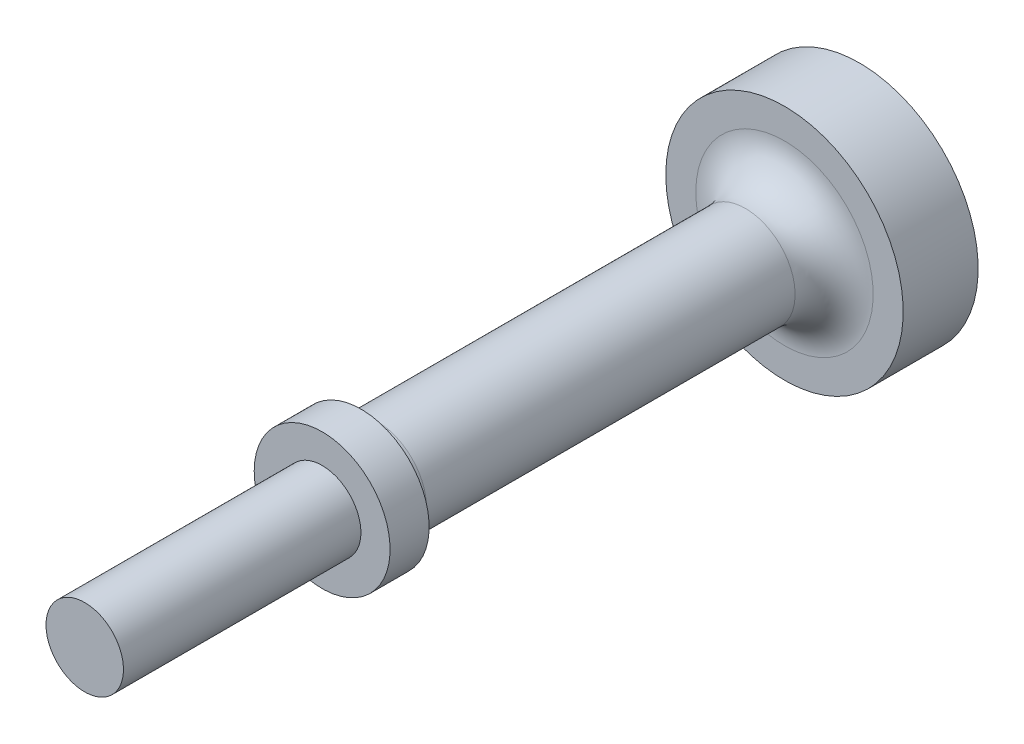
ISO-10303-21;
HEADER;
FILE_DESCRIPTION(('STEP AP214'),'2;1');
FILE_NAME('part.step','',(''),(''),'','','');
FILE_SCHEMA(('AUTOMOTIVE_DESIGN { 1 0 10303 214 1 1 1 1 }'));
ENDSEC;
DATA;
#1=APPLICATION_CONTEXT('core data for automotive mechanical design processes');
#2=APPLICATION_PROTOCOL_DEFINITION('international standard','automotive_design',2000,#1);
#3=PRODUCT_CONTEXT('',#1,'mechanical');
#4=PRODUCT('Part','Part','',(#3));
#5=PRODUCT_RELATED_PRODUCT_CATEGORY('part','',(#4));
#6=PRODUCT_DEFINITION_FORMATION('','',#4);
#7=PRODUCT_DEFINITION_CONTEXT('part definition',#1,'design');
#8=PRODUCT_DEFINITION('design','',#6,#7);
#9=PRODUCT_DEFINITION_SHAPE('','',#8);
#10=(LENGTH_UNIT() NAMED_UNIT(*) SI_UNIT(.MILLI.,.METRE.));
#11=(NAMED_UNIT(*) PLANE_ANGLE_UNIT() SI_UNIT($,.RADIAN.));
#12=(NAMED_UNIT(*) SI_UNIT($,.STERADIAN.) SOLID_ANGLE_UNIT());
#13=UNCERTAINTY_MEASURE_WITH_UNIT(LENGTH_MEASURE(1.E-05),#10,'distance_accuracy_value','');
#14=(GEOMETRIC_REPRESENTATION_CONTEXT(3) GLOBAL_UNCERTAINTY_ASSIGNED_CONTEXT((#13)) GLOBAL_UNIT_ASSIGNED_CONTEXT((#10,
#11,#12)) REPRESENTATION_CONTEXT('',''));
#15=CARTESIAN_POINT('',(0.,0.,0.));
#16=DIRECTION('',(0.,0.,1.));
#17=DIRECTION('',(1.,0.,0.));
#18=AXIS2_PLACEMENT_3D('',#15,#16,#17);
#19=CARTESIAN_POINT('',(3.14960000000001,0.,0.));
#20=DIRECTION('',(0.,0.,-1.));
#21=DIRECTION('',(-1.,0.,0.));
#22=AXIS2_PLACEMENT_3D('',#19,#20,#21);
#23=PLANE('',#22);
#24=CARTESIAN_POINT('',(0.,0.,0.));
#25=DIRECTION('',(0.,0.,-1.));
#26=DIRECTION('',(-1.,0.,0.));
#27=AXIS2_PLACEMENT_3D('',#24,#25,#26);
#28=CIRCLE('',#27,3.14960000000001);
#29=CARTESIAN_POINT('',(-3.14960000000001,0.,0.));
#30=VERTEX_POINT('',#29);
#31=EDGE_CURVE('E10',#30,#30,#28,.T.);
#32=ORIENTED_EDGE('',*,*,#31,.F.);
#33=EDGE_LOOP('',(#32));
#34=FACE_BOUND('',#33,.T.);
#35=ADVANCED_FACE('F32',(#34),#23,.F.);
#36=CARTESIAN_POINT('',(0.,0.,-62.992));
#37=DIRECTION('',(0.,0.,-1.));
#38=DIRECTION('',(-1.,0.,0.));
#39=AXIS2_PLACEMENT_3D('',#36,#37,#38);
#40=CYLINDRICAL_SURFACE('',#39,3.14960000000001);
#41=CARTESIAN_POINT('',(0.,0.,-19.304));
#42=DIRECTION('',(0.,0.,-1.));
#43=DIRECTION('',(-1.,0.,0.));
#44=AXIS2_PLACEMENT_3D('',#41,#42,#43);
#45=CIRCLE('',#44,3.14960000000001);
#46=CARTESIAN_POINT('',(-3.14960000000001,0.,-19.304));
#47=VERTEX_POINT('',#46);
#48=EDGE_CURVE('E38',#47,#47,#45,.T.);
#49=ORIENTED_EDGE('',*,*,#48,.F.);
#50=EDGE_LOOP('',(#49));
#51=FACE_BOUND('',#50,.T.);
#52=ORIENTED_EDGE('',*,*,#31,.T.);
#53=EDGE_LOOP('',(#52));
#54=FACE_BOUND('',#53,.T.);
#55=ADVANCED_FACE('F116',(#51,#54),#40,.T.);
#56=CARTESIAN_POINT('',(5.52450000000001,0.,-19.304));
#57=DIRECTION('',(0.,0.,-1.));
#58=DIRECTION('',(-1.,0.,0.));
#59=AXIS2_PLACEMENT_3D('',#56,#57,#58);
#60=PLANE('',#59);
#61=CARTESIAN_POINT('',(0.,0.,-19.304));
#62=DIRECTION('',(0.,0.,-1.));
#63=DIRECTION('',(-1.,0.,0.));
#64=AXIS2_PLACEMENT_3D('',#61,#62,#63);
#65=CIRCLE('',#64,5.52450000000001);
#66=CARTESIAN_POINT('',(-5.52450000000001,0.,-19.304));
#67=VERTEX_POINT('',#66);
#68=EDGE_CURVE('E42',#67,#67,#65,.T.);
#69=ORIENTED_EDGE('',*,*,#68,.F.);
#70=EDGE_LOOP('',(#69));
#71=FACE_BOUND('',#70,.T.);
#72=ORIENTED_EDGE('',*,*,#48,.T.);
#73=EDGE_LOOP('',(#72));
#74=FACE_BOUND('',#73,.T.);
#75=ADVANCED_FACE('F111',(#71,#74),#60,.F.);
#76=CARTESIAN_POINT('',(0.,0.,-62.992));
#77=DIRECTION('',(0.,0.,-1.));
#78=DIRECTION('',(-1.,0.,0.));
#79=AXIS2_PLACEMENT_3D('',#76,#77,#78);
#80=CYLINDRICAL_SURFACE('',#79,5.52450000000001);
#81=CARTESIAN_POINT('',(0.,0.,-22.479));
#82=DIRECTION('',(0.,0.,-1.));
#83=DIRECTION('',(-1.,0.,0.));
#84=AXIS2_PLACEMENT_3D('',#81,#82,#83);
#85=CIRCLE('',#84,5.52450000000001);
#86=CARTESIAN_POINT('',(-5.52450000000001,0.,-22.479));
#87=VERTEX_POINT('',#86);
#88=EDGE_CURVE('E46',#87,#87,#85,.T.);
#89=ORIENTED_EDGE('',*,*,#88,.F.);
#90=EDGE_LOOP('',(#89));
#91=FACE_BOUND('',#90,.T.);
#92=ORIENTED_EDGE('',*,*,#68,.T.);
#93=EDGE_LOOP('',(#92));
#94=FACE_BOUND('',#93,.T.);
#95=ADVANCED_FACE('F105',(#91,#94),#80,.T.);
#96=CARTESIAN_POINT('',(5.30860000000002,0.,-22.479));
#97=DIRECTION('',(0.,0.,1.));
#98=DIRECTION('',(1.,0.,0.));
#99=AXIS2_PLACEMENT_3D('',#96,#97,#98);
#100=PLANE('',#99);
#101=CARTESIAN_POINT('',(0.,0.,-22.479));
#102=DIRECTION('',(0.,0.,-1.));
#103=DIRECTION('',(-1.,0.,0.));
#104=AXIS2_PLACEMENT_3D('',#101,#102,#103);
#105=CIRCLE('',#104,5.30860000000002);
#106=CARTESIAN_POINT('',(-5.30860000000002,0.,-22.479));
#107=VERTEX_POINT('',#106);
#108=EDGE_CURVE('E51',#107,#107,#105,.T.);
#109=ORIENTED_EDGE('',*,*,#108,.F.);
#110=EDGE_LOOP('',(#109));
#111=FACE_BOUND('',#110,.T.);
#112=ORIENTED_EDGE('',*,*,#88,.T.);
#113=EDGE_LOOP('',(#112));
#114=FACE_BOUND('',#113,.T.);
#115=ADVANCED_FACE('F99',(#111,#114),#100,.F.);
#116=CARTESIAN_POINT('',(0.,0.,-23.749));
#117=DIRECTION('',(0.,0.,-1.));
#118=DIRECTION('',(-1.,0.,0.));
#119=AXIS2_PLACEMENT_3D('',#116,#117,#118);
#120=TOROIDAL_SURFACE('',#119,5.3086,1.27);
#121=CARTESIAN_POINT('',(0.,0.,-23.749));
#122=DIRECTION('',(0.,0.,-1.));
#123=DIRECTION('',(-1.,0.,0.));
#124=AXIS2_PLACEMENT_3D('',#121,#122,#123);
#125=CIRCLE('',#124,4.0386);
#126=CARTESIAN_POINT('',(-4.03860000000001,0.,-23.749));
#127=VERTEX_POINT('',#126);
#128=EDGE_CURVE('E54',#127,#127,#125,.T.);
#129=ORIENTED_EDGE('',*,*,#128,.F.);
#130=EDGE_LOOP('',(#129));
#131=FACE_BOUND('',#130,.T.);
#132=ORIENTED_EDGE('',*,*,#108,.T.);
#133=EDGE_LOOP('',(#132));
#134=FACE_BOUND('',#133,.T.);
#135=ADVANCED_FACE('F93',(#131,#134),#120,.F.);
#136=CARTESIAN_POINT('',(0.,0.,-62.992));
#137=DIRECTION('',(0.,0.,-1.));
#138=DIRECTION('',(-1.,0.,0.));
#139=AXIS2_PLACEMENT_3D('',#136,#137,#138);
#140=CYLINDRICAL_SURFACE('',#139,4.03860000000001);
#141=CARTESIAN_POINT('',(0.,0.,-53.721));
#142=DIRECTION('',(0.,0.,-1.));
#143=DIRECTION('',(-1.,0.,0.));
#144=AXIS2_PLACEMENT_3D('',#141,#142,#143);
#145=CIRCLE('',#144,4.03860000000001);
#146=CARTESIAN_POINT('',(-4.03860000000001,0.,-53.721));
#147=VERTEX_POINT('',#146);
#148=EDGE_CURVE('E57',#147,#147,#145,.T.);
#149=ORIENTED_EDGE('',*,*,#148,.F.);
#150=EDGE_LOOP('',(#149));
#151=FACE_BOUND('',#150,.T.);
#152=ORIENTED_EDGE('',*,*,#128,.T.);
#153=EDGE_LOOP('',(#152));
#154=FACE_BOUND('',#153,.T.);
#155=ADVANCED_FACE('F87',(#151,#154),#140,.T.);
#156=CARTESIAN_POINT('',(0.,0.,-53.721));
#157=DIRECTION('',(0.,0.,-1.));
#158=DIRECTION('',(-1.,0.,0.));
#159=AXIS2_PLACEMENT_3D('',#156,#157,#158);
#160=TOROIDAL_SURFACE('',#159,7.2136,3.175);
#161=CARTESIAN_POINT('',(0.,0.,-56.896));
#162=DIRECTION('',(0.,0.,-1.));
#163=DIRECTION('',(-1.,0.,0.));
#164=AXIS2_PLACEMENT_3D('',#161,#162,#163);
#165=CIRCLE('',#164,7.2136);
#166=CARTESIAN_POINT('',(-7.2136,0.,-56.896));
#167=VERTEX_POINT('',#166);
#168=EDGE_CURVE('E60',#167,#167,#165,.T.);
#169=ORIENTED_EDGE('',*,*,#168,.F.);
#170=EDGE_LOOP('',(#169));
#171=FACE_BOUND('',#170,.T.);
#172=ORIENTED_EDGE('',*,*,#148,.T.);
#173=EDGE_LOOP('',(#172));
#174=FACE_BOUND('',#173,.T.);
#175=ADVANCED_FACE('F81',(#171,#174),#160,.F.);
#176=CARTESIAN_POINT('',(9.652,0.,-56.896));
#177=DIRECTION('',(0.,0.,-1.));
#178=DIRECTION('',(-1.,0.,0.));
#179=AXIS2_PLACEMENT_3D('',#176,#177,#178);
#180=PLANE('',#179);
#181=CARTESIAN_POINT('',(0.,0.,-56.896));
#182=DIRECTION('',(0.,0.,-1.));
#183=DIRECTION('',(-1.,0.,0.));
#184=AXIS2_PLACEMENT_3D('',#181,#182,#183);
#185=CIRCLE('',#184,9.652);
#186=CARTESIAN_POINT('',(-9.652,0.,-56.896));
#187=VERTEX_POINT('',#186);
#188=EDGE_CURVE('E63',#187,#187,#185,.T.);
#189=ORIENTED_EDGE('',*,*,#188,.F.);
#190=EDGE_LOOP('',(#189));
#191=FACE_BOUND('',#190,.T.);
#192=ORIENTED_EDGE('',*,*,#168,.T.);
#193=EDGE_LOOP('',(#192));
#194=FACE_BOUND('',#193,.T.);
#195=ADVANCED_FACE('F75',(#191,#194),#180,.F.);
#196=CARTESIAN_POINT('',(0.,0.,-62.992));
#197=DIRECTION('',(0.,0.,-1.));
#198=DIRECTION('',(-1.,0.,0.));
#199=AXIS2_PLACEMENT_3D('',#196,#197,#198);
#200=CYLINDRICAL_SURFACE('',#199,9.652);
#201=CARTESIAN_POINT('',(0.,0.,-62.992));
#202=DIRECTION('',(0.,0.,-1.));
#203=DIRECTION('',(-1.,0.,0.));
#204=AXIS2_PLACEMENT_3D('',#201,#202,#203);
#205=CIRCLE('',#204,9.652);
#206=CARTESIAN_POINT('',(-9.652,0.,-62.992));
#207=VERTEX_POINT('',#206);
#208=EDGE_CURVE('E66',#207,#207,#205,.T.);
#209=ORIENTED_EDGE('',*,*,#208,.F.);
#210=EDGE_LOOP('',(#209));
#211=FACE_BOUND('',#210,.T.);
#212=ORIENTED_EDGE('',*,*,#188,.T.);
#213=EDGE_LOOP('',(#212));
#214=FACE_BOUND('',#213,.T.);
#215=ADVANCED_FACE('F72',(#211,#214),#200,.T.);
#216=CARTESIAN_POINT('',(0.,0.,-62.992));
#217=DIRECTION('',(0.,0.,1.));
#218=DIRECTION('',(1.,0.,0.));
#219=AXIS2_PLACEMENT_3D('',#216,#217,#218);
#220=PLANE('',#219);
#221=ORIENTED_EDGE('',*,*,#208,.T.);
#222=EDGE_LOOP('',(#221));
#223=FACE_BOUND('',#222,.T.);
#224=ADVANCED_FACE('F70',(#223),#220,.F.);
#225=CLOSED_SHELL('',(#35,#55,#75,#95,#115,#135,#155,#175,#195,#215,#224));
#226=MANIFOLD_SOLID_BREP('B2',#225);
#227=ADVANCED_BREP_SHAPE_REPRESENTATION('',(#18,#226),#14);
#228=SHAPE_DEFINITION_REPRESENTATION(#9,#227);
ENDSEC;
END-ISO-10303-21;
